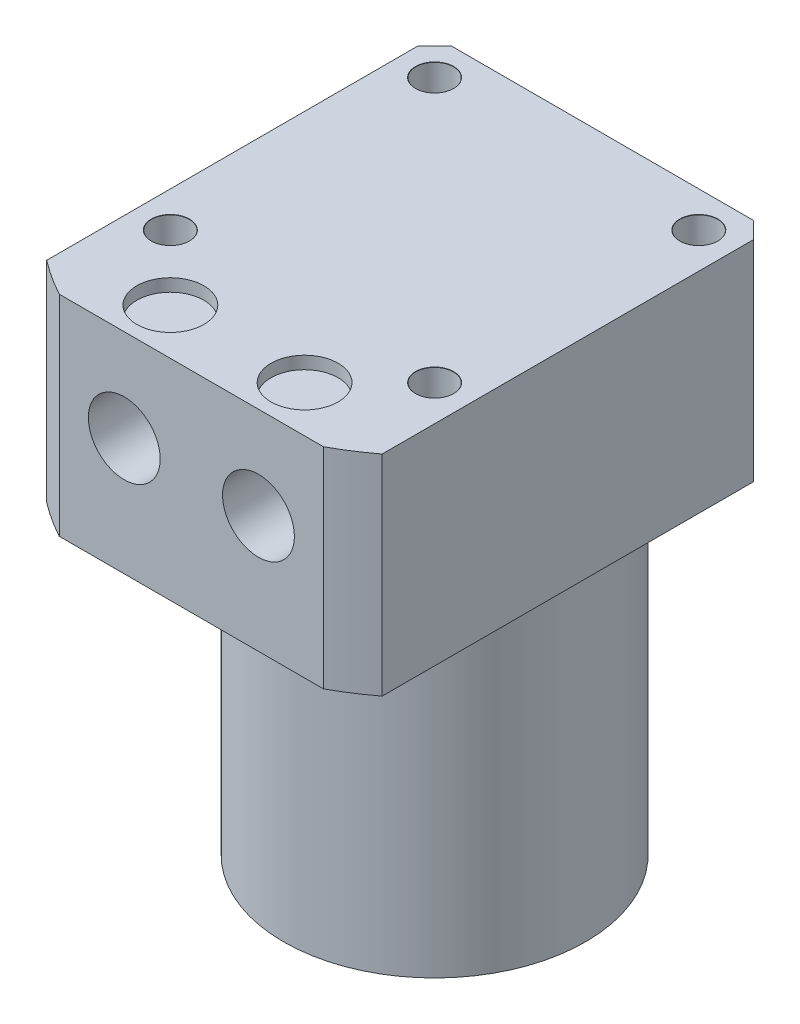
ISO-10303-21;
HEADER;
FILE_DESCRIPTION(('STEP AP214'),'2;1');
FILE_NAME('part.step','',(''),(''),'','','');
FILE_SCHEMA(('AUTOMOTIVE_DESIGN { 1 0 10303 214 1 1 1 1 }'));
ENDSEC;
DATA;
#1=APPLICATION_CONTEXT('core data for automotive mechanical design processes');
#2=APPLICATION_PROTOCOL_DEFINITION('international standard','automotive_design',2000,#1);
#3=PRODUCT_CONTEXT('',#1,'mechanical');
#4=PRODUCT('Part','Part','',(#3));
#5=PRODUCT_RELATED_PRODUCT_CATEGORY('part','',(#4));
#6=PRODUCT_DEFINITION_FORMATION('','',#4);
#7=PRODUCT_DEFINITION_CONTEXT('part definition',#1,'design');
#8=PRODUCT_DEFINITION('design','',#6,#7);
#9=PRODUCT_DEFINITION_SHAPE('','',#8);
#10=(LENGTH_UNIT() NAMED_UNIT(*) SI_UNIT(.MILLI.,.METRE.));
#11=(NAMED_UNIT(*) PLANE_ANGLE_UNIT() SI_UNIT($,.RADIAN.));
#12=(NAMED_UNIT(*) SI_UNIT($,.STERADIAN.) SOLID_ANGLE_UNIT());
#13=UNCERTAINTY_MEASURE_WITH_UNIT(LENGTH_MEASURE(1.E-05),#10,'distance_accuracy_value','');
#14=(GEOMETRIC_REPRESENTATION_CONTEXT(3) GLOBAL_UNCERTAINTY_ASSIGNED_CONTEXT((#13)) GLOBAL_UNIT_ASSIGNED_CONTEXT((#10,
#11,#12)) REPRESENTATION_CONTEXT('',''));
#15=CARTESIAN_POINT('',(0.,0.,0.));
#16=DIRECTION('',(0.,0.,1.));
#17=DIRECTION('',(1.,0.,0.));
#18=AXIS2_PLACEMENT_3D('',#15,#16,#17);
#19=CARTESIAN_POINT('',(-18.,39.5,0.));
#20=DIRECTION('',(0.,-1.,0.));
#21=DIRECTION('',(0.,0.,-1.));
#22=AXIS2_PLACEMENT_3D('',#19,#20,#21);
#23=PLANE('',#22);
#24=CARTESIAN_POINT('',(-15.75,39.5,-15.75));
#25=DIRECTION('',(0.,-1.,0.));
#26=DIRECTION('',(0.,0.,-1.));
#27=AXIS2_PLACEMENT_3D('',#24,#25,#26);
#28=CIRCLE('',#27,4.);
#29=CARTESIAN_POINT('',(-15.75,39.5,-19.75));
#30=VERTEX_POINT('',#29);
#31=EDGE_CURVE('E337',#30,#30,#28,.T.);
#32=ORIENTED_EDGE('',*,*,#31,.F.);
#33=EDGE_LOOP('',(#32));
#34=FACE_BOUND('',#33,.T.);
#35=CARTESIAN_POINT('',(15.75,39.5,-15.75));
#36=DIRECTION('',(0.,-1.,0.));
#37=DIRECTION('',(0.,0.,-1.));
#38=AXIS2_PLACEMENT_3D('',#35,#36,#37);
#39=CIRCLE('',#38,4.);
#40=CARTESIAN_POINT('',(15.75,39.5,-19.75));
#41=VERTEX_POINT('',#40);
#42=EDGE_CURVE('E352',#41,#41,#39,.T.);
#43=ORIENTED_EDGE('',*,*,#42,.F.);
#44=EDGE_LOOP('',(#43));
#45=FACE_BOUND('',#44,.T.);
#46=CARTESIAN_POINT('',(15.75,39.5,15.75));
#47=DIRECTION('',(0.,-1.,0.));
#48=DIRECTION('',(0.,0.,-1.));
#49=AXIS2_PLACEMENT_3D('',#46,#47,#48);
#50=CIRCLE('',#49,4.);
#51=CARTESIAN_POINT('',(15.75,39.5,11.75));
#52=VERTEX_POINT('',#51);
#53=EDGE_CURVE('E367',#52,#52,#50,.T.);
#54=ORIENTED_EDGE('',*,*,#53,.F.);
#55=EDGE_LOOP('',(#54));
#56=FACE_BOUND('',#55,.T.);
#57=CARTESIAN_POINT('',(-15.75,39.5,15.75));
#58=DIRECTION('',(0.,-1.,0.));
#59=DIRECTION('',(0.,0.,-1.));
#60=AXIS2_PLACEMENT_3D('',#57,#58,#59);
#61=CIRCLE('',#60,4.);
#62=CARTESIAN_POINT('',(-15.75,39.5,11.75));
#63=VERTEX_POINT('',#62);
#64=EDGE_CURVE('E382',#63,#63,#61,.T.);
#65=ORIENTED_EDGE('',*,*,#64,.F.);
#66=EDGE_LOOP('',(#65));
#67=FACE_BOUND('',#66,.T.);
#68=CARTESIAN_POINT('',(0.,39.5,0.));
#69=DIRECTION('',(0.,1.,0.));
#70=DIRECTION('',(0.,0.,1.));
#71=AXIS2_PLACEMENT_3D('',#68,#69,#70);
#72=CIRCLE('',#71,18.);
#73=CARTESIAN_POINT('',(0.,39.5,18.));
#74=VERTEX_POINT('',#73);
#75=EDGE_CURVE('E134',#74,#74,#72,.T.);
#76=ORIENTED_EDGE('',*,*,#75,.T.);
#77=EDGE_LOOP('',(#76));
#78=FACE_BOUND('',#77,.T.);
#79=DIRECTION('',(1.,0.,0.));
#80=VECTOR('',#79,1.);
#81=CARTESIAN_POINT('',(-18.,39.5,-20.));
#82=LINE('',#81,#80);
#83=CARTESIAN_POINT('',(-18.,39.5,-20.));
#84=VERTEX_POINT('',#83);
#85=CARTESIAN_POINT('',(18.,39.5,-20.));
#86=VERTEX_POINT('',#85);
#87=EDGE_CURVE('E108',#84,#86,#82,.T.);
#88=ORIENTED_EDGE('',*,*,#87,.T.);
#89=DIRECTION('',(-0.70710678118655,0.,-0.707106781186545));
#90=VECTOR('',#89,1.);
#91=CARTESIAN_POINT('',(9.99999999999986,39.5,-28.0000000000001));
#92=LINE('',#91,#90);
#93=CARTESIAN_POINT('',(20.,39.5,-18.));
#94=VERTEX_POINT('',#93);
#95=EDGE_CURVE('E42',#86,#94,#92,.F.);
#96=ORIENTED_EDGE('',*,*,#95,.T.);
#97=DIRECTION('',(0.,0.,1.));
#98=VECTOR('',#97,1.);
#99=CARTESIAN_POINT('',(20.,39.5,0.));
#100=LINE('',#99,#98);
#101=CARTESIAN_POINT('',(20.,39.5,26.2488094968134));
#102=VERTEX_POINT('',#101);
#103=EDGE_CURVE('E123',#94,#102,#100,.T.);
#104=ORIENTED_EDGE('',*,*,#103,.T.);
#105=CARTESIAN_POINT('',(0.,39.5,0.));
#106=DIRECTION('',(0.,1.,0.));
#107=DIRECTION('',(0.,0.,1.));
#108=AXIS2_PLACEMENT_3D('',#105,#106,#107);
#109=CIRCLE('',#108,33.);
#110=CARTESIAN_POINT('',(15.7480157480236,39.5,29.));
#111=VERTEX_POINT('',#110);
#112=EDGE_CURVE('E131',#111,#102,#109,.T.);
#113=ORIENTED_EDGE('',*,*,#112,.F.);
#114=DIRECTION('',(-1.,0.,0.));
#115=VECTOR('',#114,1.);
#116=CARTESIAN_POINT('',(-18.,39.5,29.));
#117=LINE('',#116,#115);
#118=CARTESIAN_POINT('',(-15.7480157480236,39.5,29.));
#119=VERTEX_POINT('',#118);
#120=EDGE_CURVE('E178',#111,#119,#117,.T.);
#121=ORIENTED_EDGE('',*,*,#120,.T.);
#122=CARTESIAN_POINT('',(-20.,39.5,26.2488094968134));
#123=VERTEX_POINT('',#122);
#124=EDGE_CURVE('E126',#123,#119,#109,.T.);
#125=ORIENTED_EDGE('',*,*,#124,.F.);
#126=DIRECTION('',(0.,0.,-1.));
#127=VECTOR('',#126,1.);
#128=CARTESIAN_POINT('',(-20.,39.5,0.));
#129=LINE('',#128,#127);
#130=CARTESIAN_POINT('',(-20.,39.5,-18.));
#131=VERTEX_POINT('',#130);
#132=EDGE_CURVE('E114',#123,#131,#129,.T.);
#133=ORIENTED_EDGE('',*,*,#132,.T.);
#134=DIRECTION('',(-0.707106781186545,0.,0.70710678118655));
#135=VECTOR('',#134,1.);
#136=CARTESIAN_POINT('',(-28.,39.5,-9.99999999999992));
#137=LINE('',#136,#135);
#138=EDGE_CURVE('E154',#131,#84,#137,.F.);
#139=ORIENTED_EDGE('',*,*,#138,.T.);
#140=EDGE_LOOP('',(#88,#96,#104,#113,#121,#125,#133,#139));
#141=FACE_BOUND('',#140,.T.);
#142=ADVANCED_FACE('F34',(#34,#45,#56,#67,#78,#141),#23,.T.);
#143=CARTESIAN_POINT('',(0.,87.0508296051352,0.));
#144=DIRECTION('',(0.,1.,0.));
#145=DIRECTION('',(0.,0.,1.));
#146=AXIS2_PLACEMENT_3D('',#143,#144,#145);
#147=CYLINDRICAL_SURFACE('',#146,33.);
#148=ORIENTED_EDGE('',*,*,#112,.T.);
#149=DIRECTION('',(0.,1.,0.));
#150=VECTOR('',#149,1.);
#151=CARTESIAN_POINT('',(20.,87.0508296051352,26.2488094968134));
#152=LINE('',#151,#150);
#153=CARTESIAN_POINT('',(20.,64.5,26.2488094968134));
#154=VERTEX_POINT('',#153);
#155=EDGE_CURVE('E127',#102,#154,#152,.T.);
#156=ORIENTED_EDGE('',*,*,#155,.T.);
#157=CARTESIAN_POINT('',(0.,64.5,0.));
#158=DIRECTION('',(0.,1.,0.));
#159=DIRECTION('',(0.,0.,1.));
#160=AXIS2_PLACEMENT_3D('',#157,#158,#159);
#161=CIRCLE('',#160,33.);
#162=CARTESIAN_POINT('',(15.7480157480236,64.5,29.));
#163=VERTEX_POINT('',#162);
#164=EDGE_CURVE('E122',#163,#154,#161,.T.);
#165=ORIENTED_EDGE('',*,*,#164,.F.);
#166=DIRECTION('',(0.,1.,0.));
#167=VECTOR('',#166,1.);
#168=CARTESIAN_POINT('',(15.7480157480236,87.0508296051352,29.));
#169=LINE('',#168,#167);
#170=EDGE_CURVE('E181',#163,#111,#169,.F.);
#171=ORIENTED_EDGE('',*,*,#170,.T.);
#172=EDGE_LOOP('',(#148,#156,#165,#171));
#173=FACE_BOUND('',#172,.T.);
#174=ADVANCED_FACE('F185',(#173),#147,.T.);
#175=ORIENTED_EDGE('',*,*,#124,.T.);
#176=DIRECTION('',(0.,1.,0.));
#177=VECTOR('',#176,1.);
#178=CARTESIAN_POINT('',(-15.7480157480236,87.0508296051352,29.));
#179=LINE('',#178,#177);
#180=CARTESIAN_POINT('',(-15.7480157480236,64.5,29.));
#181=VERTEX_POINT('',#180);
#182=EDGE_CURVE('E121',#119,#181,#179,.T.);
#183=ORIENTED_EDGE('',*,*,#182,.T.);
#184=CARTESIAN_POINT('',(-20.,64.5,26.2488094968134));
#185=VERTEX_POINT('',#184);
#186=EDGE_CURVE('E105',#185,#181,#161,.T.);
#187=ORIENTED_EDGE('',*,*,#186,.F.);
#188=DIRECTION('',(0.,1.,0.));
#189=VECTOR('',#188,1.);
#190=CARTESIAN_POINT('',(-20.,87.0508296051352,26.2488094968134));
#191=LINE('',#190,#189);
#192=EDGE_CURVE('E112',#185,#123,#191,.F.);
#193=ORIENTED_EDGE('',*,*,#192,.T.);
#194=EDGE_LOOP('',(#175,#183,#187,#193));
#195=FACE_BOUND('',#194,.T.);
#196=ADVANCED_FACE('F120',(#195),#147,.T.);
#197=CARTESIAN_POINT('',(-33.,64.5,0.));
#198=DIRECTION('',(0.,1.,0.));
#199=DIRECTION('',(0.,0.,1.));
#200=AXIS2_PLACEMENT_3D('',#197,#198,#199);
#201=PLANE('',#200);
#202=CARTESIAN_POINT('',(-15.75,64.5,-15.75));
#203=DIRECTION('',(0.,-1.,0.));
#204=DIRECTION('',(0.,0.,-1.));
#205=AXIS2_PLACEMENT_3D('',#202,#203,#204);
#206=CIRCLE('',#205,2.27499999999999);
#207=CARTESIAN_POINT('',(-15.75,64.5,-18.025));
#208=VERTEX_POINT('',#207);
#209=EDGE_CURVE('E338',#208,#208,#206,.T.);
#210=ORIENTED_EDGE('',*,*,#209,.T.);
#211=EDGE_LOOP('',(#210));
#212=FACE_BOUND('',#211,.T.);
#213=CARTESIAN_POINT('',(15.75,64.5,-15.75));
#214=DIRECTION('',(0.,-1.,0.));
#215=DIRECTION('',(0.,0.,-1.));
#216=AXIS2_PLACEMENT_3D('',#213,#214,#215);
#217=CIRCLE('',#216,2.27499999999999);
#218=CARTESIAN_POINT('',(15.75,64.5,-18.025));
#219=VERTEX_POINT('',#218);
#220=EDGE_CURVE('E349',#219,#219,#217,.T.);
#221=ORIENTED_EDGE('',*,*,#220,.T.);
#222=EDGE_LOOP('',(#221));
#223=FACE_BOUND('',#222,.T.);
#224=CARTESIAN_POINT('',(15.75,64.5,15.75));
#225=DIRECTION('',(0.,-1.,0.));
#226=DIRECTION('',(0.,0.,-1.));
#227=AXIS2_PLACEMENT_3D('',#224,#225,#226);
#228=CIRCLE('',#227,2.27499999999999);
#229=CARTESIAN_POINT('',(15.75,64.5,13.475));
#230=VERTEX_POINT('',#229);
#231=EDGE_CURVE('E364',#230,#230,#228,.T.);
#232=ORIENTED_EDGE('',*,*,#231,.T.);
#233=EDGE_LOOP('',(#232));
#234=FACE_BOUND('',#233,.T.);
#235=CARTESIAN_POINT('',(-15.75,64.5,15.75));
#236=DIRECTION('',(0.,-1.,0.));
#237=DIRECTION('',(0.,0.,-1.));
#238=AXIS2_PLACEMENT_3D('',#235,#236,#237);
#239=CIRCLE('',#238,2.27499999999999);
#240=CARTESIAN_POINT('',(-15.75,64.5,13.475));
#241=VERTEX_POINT('',#240);
#242=EDGE_CURVE('E379',#241,#241,#239,.T.);
#243=ORIENTED_EDGE('',*,*,#242,.T.);
#244=EDGE_LOOP('',(#243));
#245=FACE_BOUND('',#244,.T.);
#246=CARTESIAN_POINT('',(-8.,64.5,23.5));
#247=DIRECTION('',(0.,1.,0.));
#248=DIRECTION('',(0.,0.,1.));
#249=AXIS2_PLACEMENT_3D('',#246,#247,#248);
#250=CIRCLE('',#249,4.);
#251=CARTESIAN_POINT('',(-8.,64.5,27.5));
#252=VERTEX_POINT('',#251);
#253=EDGE_CURVE('E406',#252,#252,#250,.T.);
#254=ORIENTED_EDGE('',*,*,#253,.F.);
#255=EDGE_LOOP('',(#254));
#256=FACE_BOUND('',#255,.T.);
#257=CARTESIAN_POINT('',(8.,64.5,23.5));
#258=DIRECTION('',(0.,1.,0.));
#259=DIRECTION('',(0.,0.,1.));
#260=AXIS2_PLACEMENT_3D('',#257,#258,#259);
#261=CIRCLE('',#260,4.);
#262=CARTESIAN_POINT('',(8.,64.5,27.5));
#263=VERTEX_POINT('',#262);
#264=EDGE_CURVE('E171',#263,#263,#261,.T.);
#265=ORIENTED_EDGE('',*,*,#264,.F.);
#266=EDGE_LOOP('',(#265));
#267=FACE_BOUND('',#266,.T.);
#268=DIRECTION('',(0.,0.,-1.));
#269=VECTOR('',#268,1.);
#270=CARTESIAN_POINT('',(20.,64.5,0.));
#271=LINE('',#270,#269);
#272=CARTESIAN_POINT('',(20.,64.5,-18.));
#273=VERTEX_POINT('',#272);
#274=EDGE_CURVE('E140',#154,#273,#271,.T.);
#275=ORIENTED_EDGE('',*,*,#274,.T.);
#276=DIRECTION('',(0.70710678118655,0.,0.707106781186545));
#277=VECTOR('',#276,1.);
#278=CARTESIAN_POINT('',(2.49999999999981,64.5,-35.5));
#279=LINE('',#278,#277);
#280=CARTESIAN_POINT('',(18.,64.5,-20.));
#281=VERTEX_POINT('',#280);
#282=EDGE_CURVE('E148',#273,#281,#279,.F.);
#283=ORIENTED_EDGE('',*,*,#282,.T.);
#284=DIRECTION('',(-1.,0.,0.));
#285=VECTOR('',#284,1.);
#286=CARTESIAN_POINT('',(-20.,64.5,-20.));
#287=LINE('',#286,#285);
#288=CARTESIAN_POINT('',(-18.,64.5,-20.));
#289=VERTEX_POINT('',#288);
#290=EDGE_CURVE('E109',#281,#289,#287,.T.);
#291=ORIENTED_EDGE('',*,*,#290,.T.);
#292=DIRECTION('',(0.707106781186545,0.,-0.70710678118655));
#293=VECTOR('',#292,1.);
#294=CARTESIAN_POINT('',(-35.4999999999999,64.5,-2.49999999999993));
#295=LINE('',#294,#293);
#296=CARTESIAN_POINT('',(-20.,64.5,-18.));
#297=VERTEX_POINT('',#296);
#298=EDGE_CURVE('E107',#289,#297,#295,.F.);
#299=ORIENTED_EDGE('',*,*,#298,.T.);
#300=DIRECTION('',(0.,0.,1.));
#301=VECTOR('',#300,1.);
#302=CARTESIAN_POINT('',(-20.,64.5,-20.));
#303=LINE('',#302,#301);
#304=EDGE_CURVE('E99',#297,#185,#303,.T.);
#305=ORIENTED_EDGE('',*,*,#304,.T.);
#306=ORIENTED_EDGE('',*,*,#186,.T.);
#307=DIRECTION('',(1.,0.,0.));
#308=VECTOR('',#307,1.);
#309=CARTESIAN_POINT('',(-33.,64.5,29.));
#310=LINE('',#309,#308);
#311=EDGE_CURVE('E142',#181,#163,#310,.T.);
#312=ORIENTED_EDGE('',*,*,#311,.T.);
#313=ORIENTED_EDGE('',*,*,#164,.T.);
#314=EDGE_LOOP('',(#275,#283,#291,#299,#305,#306,#312,#313));
#315=FACE_BOUND('',#314,.T.);
#316=ADVANCED_FACE('F102',(#212,#223,#234,#245,#256,#267,#315),#201,.T.);
#317=CARTESIAN_POINT('',(0.,0.,0.));
#318=DIRECTION('',(0.,-1.,0.));
#319=DIRECTION('',(0.,0.,-1.));
#320=AXIS2_PLACEMENT_3D('',#317,#318,#319);
#321=PLANE('',#320);
#322=CARTESIAN_POINT('',(0.,0.,0.));
#323=DIRECTION('',(0.,1.,0.));
#324=DIRECTION('',(0.,0.,1.));
#325=AXIS2_PLACEMENT_3D('',#322,#323,#324);
#326=CIRCLE('',#325,18.);
#327=CARTESIAN_POINT('',(0.,0.,18.));
#328=VERTEX_POINT('',#327);
#329=EDGE_CURVE('E137',#328,#328,#326,.T.);
#330=ORIENTED_EDGE('',*,*,#329,.F.);
#331=EDGE_LOOP('',(#330));
#332=FACE_BOUND('',#331,.T.);
#333=ADVANCED_FACE('F213',(#332),#321,.T.);
#334=CARTESIAN_POINT('',(0.,87.0508296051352,0.));
#335=DIRECTION('',(0.,1.,0.));
#336=DIRECTION('',(0.,0.,1.));
#337=AXIS2_PLACEMENT_3D('',#334,#335,#336);
#338=CYLINDRICAL_SURFACE('',#337,18.);
#339=ORIENTED_EDGE('',*,*,#329,.T.);
#340=EDGE_LOOP('',(#339));
#341=FACE_BOUND('',#340,.T.);
#342=ORIENTED_EDGE('',*,*,#75,.F.);
#343=EDGE_LOOP('',(#342));
#344=FACE_BOUND('',#343,.T.);
#345=ADVANCED_FACE('F210',(#341,#344),#338,.T.);
#346=CARTESIAN_POINT('',(-20.,0.,-20.));
#347=DIRECTION('',(0.,0.,-1.));
#348=DIRECTION('',(-1.,0.,0.));
#349=AXIS2_PLACEMENT_3D('',#346,#347,#348);
#350=PLANE('',#349);
#351=ORIENTED_EDGE('',*,*,#290,.F.);
#352=DIRECTION('',(0.,-1.,0.));
#353=VECTOR('',#352,1.);
#354=CARTESIAN_POINT('',(18.,0.,-20.));
#355=LINE('',#354,#353);
#356=EDGE_CURVE('E55',#281,#86,#355,.T.);
#357=ORIENTED_EDGE('',*,*,#356,.T.);
#358=ORIENTED_EDGE('',*,*,#87,.F.);
#359=DIRECTION('',(0.,1.,0.));
#360=VECTOR('',#359,1.);
#361=CARTESIAN_POINT('',(-18.,0.,-20.));
#362=LINE('',#361,#360);
#363=EDGE_CURVE('E150',#84,#289,#362,.T.);
#364=ORIENTED_EDGE('',*,*,#363,.T.);
#365=EDGE_LOOP('',(#351,#357,#358,#364));
#366=FACE_BOUND('',#365,.T.);
#367=ADVANCED_FACE('F166',(#366),#350,.T.);
#368=CARTESIAN_POINT('',(-20.,0.,-20.));
#369=DIRECTION('',(-1.,0.,0.));
#370=DIRECTION('',(0.,0.,1.));
#371=AXIS2_PLACEMENT_3D('',#368,#369,#370);
#372=PLANE('',#371);
#373=ORIENTED_EDGE('',*,*,#304,.F.);
#374=DIRECTION('',(0.,-1.,0.));
#375=VECTOR('',#374,1.);
#376=CARTESIAN_POINT('',(-20.,0.,-18.));
#377=LINE('',#376,#375);
#378=EDGE_CURVE('E12',#297,#131,#377,.T.);
#379=ORIENTED_EDGE('',*,*,#378,.T.);
#380=ORIENTED_EDGE('',*,*,#132,.F.);
#381=ORIENTED_EDGE('',*,*,#192,.F.);
#382=EDGE_LOOP('',(#373,#379,#380,#381));
#383=FACE_BOUND('',#382,.T.);
#384=ADVANCED_FACE('F113',(#383),#372,.T.);
#385=CARTESIAN_POINT('',(20.,0.,-20.));
#386=DIRECTION('',(1.,0.,0.));
#387=DIRECTION('',(0.,0.,-1.));
#388=AXIS2_PLACEMENT_3D('',#385,#386,#387);
#389=PLANE('',#388);
#390=ORIENTED_EDGE('',*,*,#103,.F.);
#391=DIRECTION('',(0.,1.,0.));
#392=VECTOR('',#391,1.);
#393=CARTESIAN_POINT('',(20.,0.,-18.));
#394=LINE('',#393,#392);
#395=EDGE_CURVE('E144',#94,#273,#394,.T.);
#396=ORIENTED_EDGE('',*,*,#395,.T.);
#397=ORIENTED_EDGE('',*,*,#274,.F.);
#398=ORIENTED_EDGE('',*,*,#155,.F.);
#399=EDGE_LOOP('',(#390,#396,#397,#398));
#400=FACE_BOUND('',#399,.T.);
#401=ADVANCED_FACE('F163',(#400),#389,.T.);
#402=CARTESIAN_POINT('',(-20.,0.,29.));
#403=DIRECTION('',(0.,0.,1.));
#404=DIRECTION('',(1.,0.,0.));
#405=AXIS2_PLACEMENT_3D('',#402,#403,#404);
#406=PLANE('',#405);
#407=CARTESIAN_POINT('',(-8.,53.5,29.));
#408=DIRECTION('',(0.,0.,1.));
#409=DIRECTION('',(1.,0.,0.));
#410=AXIS2_PLACEMENT_3D('',#407,#408,#409);
#411=CIRCLE('',#410,4.283);
#412=CARTESIAN_POINT('',(-3.717,53.5,29.));
#413=VERTEX_POINT('',#412);
#414=EDGE_CURVE('E394',#413,#413,#411,.T.);
#415=ORIENTED_EDGE('',*,*,#414,.F.);
#416=EDGE_LOOP('',(#415));
#417=FACE_BOUND('',#416,.T.);
#418=CARTESIAN_POINT('',(8.,53.5,29.));
#419=DIRECTION('',(0.,0.,1.));
#420=DIRECTION('',(1.,0.,0.));
#421=AXIS2_PLACEMENT_3D('',#418,#419,#420);
#422=CIRCLE('',#421,4.283);
#423=CARTESIAN_POINT('',(12.283,53.5,29.));
#424=VERTEX_POINT('',#423);
#425=EDGE_CURVE('E400',#424,#424,#422,.T.);
#426=ORIENTED_EDGE('',*,*,#425,.F.);
#427=EDGE_LOOP('',(#426));
#428=FACE_BOUND('',#427,.T.);
#429=ORIENTED_EDGE('',*,*,#311,.F.);
#430=ORIENTED_EDGE('',*,*,#182,.F.);
#431=ORIENTED_EDGE('',*,*,#120,.F.);
#432=ORIENTED_EDGE('',*,*,#170,.F.);
#433=EDGE_LOOP('',(#429,#430,#431,#432));
#434=FACE_BOUND('',#433,.T.);
#435=ADVANCED_FACE('F187',(#417,#428,#434),#406,.T.);
#436=CARTESIAN_POINT('',(20.,0.,-18.));
#437=DIRECTION('',(-0.707106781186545,0.,0.70710678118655));
#438=DIRECTION('',(0.70710678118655,0.,0.707106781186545));
#439=AXIS2_PLACEMENT_3D('',#436,#437,#438);
#440=PLANE('',#439);
#441=ORIENTED_EDGE('',*,*,#95,.F.);
#442=ORIENTED_EDGE('',*,*,#356,.F.);
#443=ORIENTED_EDGE('',*,*,#282,.F.);
#444=ORIENTED_EDGE('',*,*,#395,.F.);
#445=EDGE_LOOP('',(#441,#442,#443,#444));
#446=FACE_BOUND('',#445,.T.);
#447=ADVANCED_FACE('F165',(#446),#440,.F.);
#448=CARTESIAN_POINT('',(-18.,0.,-20.));
#449=DIRECTION('',(0.70710678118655,0.,0.707106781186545));
#450=DIRECTION('',(0.707106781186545,0.,-0.70710678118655));
#451=AXIS2_PLACEMENT_3D('',#448,#449,#450);
#452=PLANE('',#451);
#453=ORIENTED_EDGE('',*,*,#138,.F.);
#454=ORIENTED_EDGE('',*,*,#378,.F.);
#455=ORIENTED_EDGE('',*,*,#298,.F.);
#456=ORIENTED_EDGE('',*,*,#363,.F.);
#457=EDGE_LOOP('',(#453,#454,#455,#456));
#458=FACE_BOUND('',#457,.T.);
#459=ADVANCED_FACE('F36',(#458),#452,.F.);
#460=CARTESIAN_POINT('',(8.,63.,23.5));
#461=DIRECTION('',(0.,-1.,0.));
#462=DIRECTION('',(0.,0.,-1.));
#463=AXIS2_PLACEMENT_3D('',#460,#461,#462);
#464=PLANE('',#463);
#465=CARTESIAN_POINT('',(8.,63.,23.5));
#466=DIRECTION('',(0.,1.,0.));
#467=DIRECTION('',(0.,0.,1.));
#468=AXIS2_PLACEMENT_3D('',#465,#466,#467);
#469=CIRCLE('',#468,4.);
#470=CARTESIAN_POINT('',(8.,63.,27.5));
#471=VERTEX_POINT('',#470);
#472=EDGE_CURVE('E168',#471,#471,#469,.T.);
#473=ORIENTED_EDGE('',*,*,#472,.T.);
#474=EDGE_LOOP('',(#473));
#475=FACE_BOUND('',#474,.T.);
#476=ADVANCED_FACE('F191',(#475),#464,.F.);
#477=CARTESIAN_POINT('',(8.,64.5,23.5));
#478=DIRECTION('',(0.,1.,0.));
#479=DIRECTION('',(0.,0.,1.));
#480=AXIS2_PLACEMENT_3D('',#477,#478,#479);
#481=CYLINDRICAL_SURFACE('',#480,4.);
#482=ORIENTED_EDGE('',*,*,#472,.F.);
#483=EDGE_LOOP('',(#482));
#484=FACE_BOUND('',#483,.T.);
#485=ORIENTED_EDGE('',*,*,#264,.T.);
#486=EDGE_LOOP('',(#485));
#487=FACE_BOUND('',#486,.T.);
#488=ADVANCED_FACE('F196',(#484,#487),#481,.F.);
#489=CARTESIAN_POINT('',(-8.,63.,23.5));
#490=DIRECTION('',(0.,-1.,0.));
#491=DIRECTION('',(0.,0.,-1.));
#492=AXIS2_PLACEMENT_3D('',#489,#490,#491);
#493=PLANE('',#492);
#494=CARTESIAN_POINT('',(-8.,63.,23.5));
#495=DIRECTION('',(0.,1.,0.));
#496=DIRECTION('',(0.,0.,1.));
#497=AXIS2_PLACEMENT_3D('',#494,#495,#496);
#498=CIRCLE('',#497,4.);
#499=CARTESIAN_POINT('',(-8.,63.,27.5));
#500=VERTEX_POINT('',#499);
#501=EDGE_CURVE('E409',#500,#500,#498,.T.);
#502=ORIENTED_EDGE('',*,*,#501,.T.);
#503=EDGE_LOOP('',(#502));
#504=FACE_BOUND('',#503,.T.);
#505=ADVANCED_FACE('F242',(#504),#493,.F.);
#506=CARTESIAN_POINT('',(-8.,64.5,23.5));
#507=DIRECTION('',(0.,1.,0.));
#508=DIRECTION('',(0.,0.,1.));
#509=AXIS2_PLACEMENT_3D('',#506,#507,#508);
#510=CYLINDRICAL_SURFACE('',#509,4.);
#511=ORIENTED_EDGE('',*,*,#501,.F.);
#512=EDGE_LOOP('',(#511));
#513=FACE_BOUND('',#512,.T.);
#514=ORIENTED_EDGE('',*,*,#253,.T.);
#515=EDGE_LOOP('',(#514));
#516=FACE_BOUND('',#515,.T.);
#517=ADVANCED_FACE('F246',(#513,#516),#510,.F.);
#518=CARTESIAN_POINT('',(7.99999999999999,53.5,6.82));
#519=DIRECTION('',(0.,0.,-1.));
#520=DIRECTION('',(-1.,0.,0.));
#521=AXIS2_PLACEMENT_3D('',#518,#519,#520);
#522=PLANE('',#521);
#523=CARTESIAN_POINT('',(8.,53.5,6.82));
#524=DIRECTION('',(0.,0.,1.));
#525=DIRECTION('',(1.,0.,0.));
#526=AXIS2_PLACEMENT_3D('',#523,#524,#525);
#527=CIRCLE('',#526,4.283);
#528=CARTESIAN_POINT('',(12.283,53.5,6.82));
#529=VERTEX_POINT('',#528);
#530=EDGE_CURVE('E403',#529,#529,#527,.T.);
#531=ORIENTED_EDGE('',*,*,#530,.T.);
#532=EDGE_LOOP('',(#531));
#533=FACE_BOUND('',#532,.T.);
#534=ADVANCED_FACE('F250',(#533),#522,.F.);
#535=CARTESIAN_POINT('',(8.,53.5,29.));
#536=DIRECTION('',(0.,0.,1.));
#537=DIRECTION('',(1.,0.,0.));
#538=AXIS2_PLACEMENT_3D('',#535,#536,#537);
#539=CYLINDRICAL_SURFACE('',#538,4.283);
#540=ORIENTED_EDGE('',*,*,#530,.F.);
#541=EDGE_LOOP('',(#540));
#542=FACE_BOUND('',#541,.T.);
#543=ORIENTED_EDGE('',*,*,#425,.T.);
#544=EDGE_LOOP('',(#543));
#545=FACE_BOUND('',#544,.T.);
#546=ADVANCED_FACE('F254',(#542,#545),#539,.F.);
#547=CARTESIAN_POINT('',(-8.00000000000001,53.5,6.82));
#548=DIRECTION('',(0.,0.,-1.));
#549=DIRECTION('',(-1.,0.,0.));
#550=AXIS2_PLACEMENT_3D('',#547,#548,#549);
#551=PLANE('',#550);
#552=CARTESIAN_POINT('',(-8.,53.5,6.82));
#553=DIRECTION('',(0.,0.,1.));
#554=DIRECTION('',(1.,0.,0.));
#555=AXIS2_PLACEMENT_3D('',#552,#553,#554);
#556=CIRCLE('',#555,4.283);
#557=CARTESIAN_POINT('',(-3.717,53.5,6.82));
#558=VERTEX_POINT('',#557);
#559=EDGE_CURVE('E397',#558,#558,#556,.T.);
#560=ORIENTED_EDGE('',*,*,#559,.T.);
#561=EDGE_LOOP('',(#560));
#562=FACE_BOUND('',#561,.T.);
#563=ADVANCED_FACE('F258',(#562),#551,.F.);
#564=CARTESIAN_POINT('',(-8.,53.5,29.));
#565=DIRECTION('',(0.,0.,1.));
#566=DIRECTION('',(1.,0.,0.));
#567=AXIS2_PLACEMENT_3D('',#564,#565,#566);
#568=CYLINDRICAL_SURFACE('',#567,4.283);
#569=ORIENTED_EDGE('',*,*,#559,.F.);
#570=EDGE_LOOP('',(#569));
#571=FACE_BOUND('',#570,.T.);
#572=ORIENTED_EDGE('',*,*,#414,.T.);
#573=EDGE_LOOP('',(#572));
#574=FACE_BOUND('',#573,.T.);
#575=ADVANCED_FACE('F262',(#571,#574),#568,.F.);
#576=CARTESIAN_POINT('',(-15.75,64.475,15.75));
#577=DIRECTION('',(0.,1.,0.));
#578=DIRECTION('',(0.,0.,1.));
#579=AXIS2_PLACEMENT_3D('',#576,#577,#578);
#580=CONICAL_SURFACE('',#579,2.25,0.785398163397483);
#581=ORIENTED_EDGE('',*,*,#242,.F.);
#582=EDGE_LOOP('',(#581));
#583=FACE_BOUND('',#582,.T.);
#584=CARTESIAN_POINT('',(-15.75,64.475,15.75));
#585=DIRECTION('',(0.,-1.,0.));
#586=DIRECTION('',(0.,0.,-1.));
#587=AXIS2_PLACEMENT_3D('',#584,#585,#586);
#588=CIRCLE('',#587,2.25);
#589=CARTESIAN_POINT('',(-15.75,64.475,13.5));
#590=VERTEX_POINT('',#589);
#591=EDGE_CURVE('E391',#590,#590,#588,.T.);
#592=ORIENTED_EDGE('',*,*,#591,.T.);
#593=EDGE_LOOP('',(#592));
#594=FACE_BOUND('',#593,.T.);
#595=ADVANCED_FACE('F266',(#583,#594),#580,.F.);
#596=CARTESIAN_POINT('',(-15.75,39.5,15.75));
#597=DIRECTION('',(0.,-1.,0.));
#598=DIRECTION('',(0.,0.,-1.));
#599=AXIS2_PLACEMENT_3D('',#596,#597,#598);
#600=CYLINDRICAL_SURFACE('',#599,2.25);
#601=ORIENTED_EDGE('',*,*,#591,.F.);
#602=EDGE_LOOP('',(#601));
#603=FACE_BOUND('',#602,.T.);
#604=CARTESIAN_POINT('',(-15.75,43.5,15.75));
#605=DIRECTION('',(0.,-1.,0.));
#606=DIRECTION('',(0.,0.,-1.));
#607=AXIS2_PLACEMENT_3D('',#604,#605,#606);
#608=CIRCLE('',#607,2.25);
#609=CARTESIAN_POINT('',(-15.75,43.5,13.5));
#610=VERTEX_POINT('',#609);
#611=EDGE_CURVE('E388',#610,#610,#608,.T.);
#612=ORIENTED_EDGE('',*,*,#611,.T.);
#613=EDGE_LOOP('',(#612));
#614=FACE_BOUND('',#613,.T.);
#615=ADVANCED_FACE('F270',(#603,#614),#600,.F.);
#616=CARTESIAN_POINT('',(-13.5,43.5,15.75));
#617=DIRECTION('',(0.,1.,0.));
#618=DIRECTION('',(0.,0.,1.));
#619=AXIS2_PLACEMENT_3D('',#616,#617,#618);
#620=PLANE('',#619);
#621=ORIENTED_EDGE('',*,*,#611,.F.);
#622=EDGE_LOOP('',(#621));
#623=FACE_BOUND('',#622,.T.);
#624=CARTESIAN_POINT('',(-15.75,43.5,15.75));
#625=DIRECTION('',(0.,-1.,0.));
#626=DIRECTION('',(0.,0.,-1.));
#627=AXIS2_PLACEMENT_3D('',#624,#625,#626);
#628=CIRCLE('',#627,4.);
#629=CARTESIAN_POINT('',(-15.75,43.5,11.75));
#630=VERTEX_POINT('',#629);
#631=EDGE_CURVE('E385',#630,#630,#628,.T.);
#632=ORIENTED_EDGE('',*,*,#631,.T.);
#633=EDGE_LOOP('',(#632));
#634=FACE_BOUND('',#633,.T.);
#635=ADVANCED_FACE('F274',(#623,#634),#620,.F.);
#636=CARTESIAN_POINT('',(-15.75,39.5,15.75));
#637=DIRECTION('',(0.,-1.,0.));
#638=DIRECTION('',(0.,0.,-1.));
#639=AXIS2_PLACEMENT_3D('',#636,#637,#638);
#640=CYLINDRICAL_SURFACE('',#639,4.);
#641=ORIENTED_EDGE('',*,*,#631,.F.);
#642=EDGE_LOOP('',(#641));
#643=FACE_BOUND('',#642,.T.);
#644=ORIENTED_EDGE('',*,*,#64,.T.);
#645=EDGE_LOOP('',(#644));
#646=FACE_BOUND('',#645,.T.);
#647=ADVANCED_FACE('F278',(#643,#646),#640,.F.);
#648=CARTESIAN_POINT('',(15.75,64.475,15.75));
#649=DIRECTION('',(0.,1.,0.));
#650=DIRECTION('',(0.,0.,1.));
#651=AXIS2_PLACEMENT_3D('',#648,#649,#650);
#652=CONICAL_SURFACE('',#651,2.25,0.785398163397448);
#653=ORIENTED_EDGE('',*,*,#231,.F.);
#654=EDGE_LOOP('',(#653));
#655=FACE_BOUND('',#654,.T.);
#656=CARTESIAN_POINT('',(15.75,64.475,15.75));
#657=DIRECTION('',(0.,-1.,0.));
#658=DIRECTION('',(0.,0.,-1.));
#659=AXIS2_PLACEMENT_3D('',#656,#657,#658);
#660=CIRCLE('',#659,2.25);
#661=CARTESIAN_POINT('',(15.75,64.475,13.5));
#662=VERTEX_POINT('',#661);
#663=EDGE_CURVE('E376',#662,#662,#660,.T.);
#664=ORIENTED_EDGE('',*,*,#663,.T.);
#665=EDGE_LOOP('',(#664));
#666=FACE_BOUND('',#665,.T.);
#667=ADVANCED_FACE('F282',(#655,#666),#652,.F.);
#668=CARTESIAN_POINT('',(15.75,39.5,15.75));
#669=DIRECTION('',(0.,-1.,0.));
#670=DIRECTION('',(0.,0.,-1.));
#671=AXIS2_PLACEMENT_3D('',#668,#669,#670);
#672=CYLINDRICAL_SURFACE('',#671,2.25);
#673=ORIENTED_EDGE('',*,*,#663,.F.);
#674=EDGE_LOOP('',(#673));
#675=FACE_BOUND('',#674,.T.);
#676=CARTESIAN_POINT('',(15.75,43.5,15.75));
#677=DIRECTION('',(0.,-1.,0.));
#678=DIRECTION('',(0.,0.,-1.));
#679=AXIS2_PLACEMENT_3D('',#676,#677,#678);
#680=CIRCLE('',#679,2.25);
#681=CARTESIAN_POINT('',(15.75,43.5,13.5));
#682=VERTEX_POINT('',#681);
#683=EDGE_CURVE('E373',#682,#682,#680,.T.);
#684=ORIENTED_EDGE('',*,*,#683,.T.);
#685=EDGE_LOOP('',(#684));
#686=FACE_BOUND('',#685,.T.);
#687=ADVANCED_FACE('F286',(#675,#686),#672,.F.);
#688=CARTESIAN_POINT('',(18.,43.5,15.75));
#689=DIRECTION('',(0.,1.,0.));
#690=DIRECTION('',(0.,0.,1.));
#691=AXIS2_PLACEMENT_3D('',#688,#689,#690);
#692=PLANE('',#691);
#693=ORIENTED_EDGE('',*,*,#683,.F.);
#694=EDGE_LOOP('',(#693));
#695=FACE_BOUND('',#694,.T.);
#696=CARTESIAN_POINT('',(15.75,43.5,15.75));
#697=DIRECTION('',(0.,-1.,0.));
#698=DIRECTION('',(0.,0.,-1.));
#699=AXIS2_PLACEMENT_3D('',#696,#697,#698);
#700=CIRCLE('',#699,4.);
#701=CARTESIAN_POINT('',(15.75,43.5,11.75));
#702=VERTEX_POINT('',#701);
#703=EDGE_CURVE('E370',#702,#702,#700,.T.);
#704=ORIENTED_EDGE('',*,*,#703,.T.);
#705=EDGE_LOOP('',(#704));
#706=FACE_BOUND('',#705,.T.);
#707=ADVANCED_FACE('F290',(#695,#706),#692,.F.);
#708=CARTESIAN_POINT('',(15.75,39.5,15.75));
#709=DIRECTION('',(0.,-1.,0.));
#710=DIRECTION('',(0.,0.,-1.));
#711=AXIS2_PLACEMENT_3D('',#708,#709,#710);
#712=CYLINDRICAL_SURFACE('',#711,4.);
#713=ORIENTED_EDGE('',*,*,#703,.F.);
#714=EDGE_LOOP('',(#713));
#715=FACE_BOUND('',#714,.T.);
#716=ORIENTED_EDGE('',*,*,#53,.T.);
#717=EDGE_LOOP('',(#716));
#718=FACE_BOUND('',#717,.T.);
#719=ADVANCED_FACE('F294',(#715,#718),#712,.F.);
#720=CARTESIAN_POINT('',(15.75,64.475,-15.75));
#721=DIRECTION('',(0.,1.,0.));
#722=DIRECTION('',(0.,0.,1.));
#723=AXIS2_PLACEMENT_3D('',#720,#721,#722);
#724=CONICAL_SURFACE('',#723,2.25,0.785398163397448);
#725=ORIENTED_EDGE('',*,*,#220,.F.);
#726=EDGE_LOOP('',(#725));
#727=FACE_BOUND('',#726,.T.);
#728=CARTESIAN_POINT('',(15.75,64.475,-15.75));
#729=DIRECTION('',(0.,-1.,0.));
#730=DIRECTION('',(0.,0.,-1.));
#731=AXIS2_PLACEMENT_3D('',#728,#729,#730);
#732=CIRCLE('',#731,2.25);
#733=CARTESIAN_POINT('',(15.75,64.475,-18.));
#734=VERTEX_POINT('',#733);
#735=EDGE_CURVE('E361',#734,#734,#732,.T.);
#736=ORIENTED_EDGE('',*,*,#735,.T.);
#737=EDGE_LOOP('',(#736));
#738=FACE_BOUND('',#737,.T.);
#739=ADVANCED_FACE('F298',(#727,#738),#724,.F.);
#740=CARTESIAN_POINT('',(15.75,39.5,-15.75));
#741=DIRECTION('',(0.,-1.,0.));
#742=DIRECTION('',(0.,0.,-1.));
#743=AXIS2_PLACEMENT_3D('',#740,#741,#742);
#744=CYLINDRICAL_SURFACE('',#743,2.25);
#745=ORIENTED_EDGE('',*,*,#735,.F.);
#746=EDGE_LOOP('',(#745));
#747=FACE_BOUND('',#746,.T.);
#748=CARTESIAN_POINT('',(15.75,43.5,-15.75));
#749=DIRECTION('',(0.,-1.,0.));
#750=DIRECTION('',(0.,0.,-1.));
#751=AXIS2_PLACEMENT_3D('',#748,#749,#750);
#752=CIRCLE('',#751,2.25);
#753=CARTESIAN_POINT('',(15.75,43.5,-18.));
#754=VERTEX_POINT('',#753);
#755=EDGE_CURVE('E358',#754,#754,#752,.T.);
#756=ORIENTED_EDGE('',*,*,#755,.T.);
#757=EDGE_LOOP('',(#756));
#758=FACE_BOUND('',#757,.T.);
#759=ADVANCED_FACE('F302',(#747,#758),#744,.F.);
#760=CARTESIAN_POINT('',(18.,43.5,-15.75));
#761=DIRECTION('',(0.,1.,0.));
#762=DIRECTION('',(0.,0.,1.));
#763=AXIS2_PLACEMENT_3D('',#760,#761,#762);
#764=PLANE('',#763);
#765=ORIENTED_EDGE('',*,*,#755,.F.);
#766=EDGE_LOOP('',(#765));
#767=FACE_BOUND('',#766,.T.);
#768=CARTESIAN_POINT('',(15.75,43.5,-15.75));
#769=DIRECTION('',(0.,-1.,0.));
#770=DIRECTION('',(0.,0.,-1.));
#771=AXIS2_PLACEMENT_3D('',#768,#769,#770);
#772=CIRCLE('',#771,4.);
#773=CARTESIAN_POINT('',(15.75,43.5,-19.75));
#774=VERTEX_POINT('',#773);
#775=EDGE_CURVE('E355',#774,#774,#772,.T.);
#776=ORIENTED_EDGE('',*,*,#775,.T.);
#777=EDGE_LOOP('',(#776));
#778=FACE_BOUND('',#777,.T.);
#779=ADVANCED_FACE('F306',(#767,#778),#764,.F.);
#780=CARTESIAN_POINT('',(15.75,39.5,-15.75));
#781=DIRECTION('',(0.,-1.,0.));
#782=DIRECTION('',(0.,0.,-1.));
#783=AXIS2_PLACEMENT_3D('',#780,#781,#782);
#784=CYLINDRICAL_SURFACE('',#783,4.);
#785=ORIENTED_EDGE('',*,*,#775,.F.);
#786=EDGE_LOOP('',(#785));
#787=FACE_BOUND('',#786,.T.);
#788=ORIENTED_EDGE('',*,*,#42,.T.);
#789=EDGE_LOOP('',(#788));
#790=FACE_BOUND('',#789,.T.);
#791=ADVANCED_FACE('F310',(#787,#790),#784,.F.);
#792=CARTESIAN_POINT('',(-15.75,64.475,-15.75));
#793=DIRECTION('',(0.,1.,0.));
#794=DIRECTION('',(0.,0.,1.));
#795=AXIS2_PLACEMENT_3D('',#792,#793,#794);
#796=CONICAL_SURFACE('',#795,2.25,0.785398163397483);
#797=ORIENTED_EDGE('',*,*,#209,.F.);
#798=EDGE_LOOP('',(#797));
#799=FACE_BOUND('',#798,.T.);
#800=CARTESIAN_POINT('',(-15.75,64.475,-15.75));
#801=DIRECTION('',(0.,-1.,0.));
#802=DIRECTION('',(0.,0.,-1.));
#803=AXIS2_PLACEMENT_3D('',#800,#801,#802);
#804=CIRCLE('',#803,2.25);
#805=CARTESIAN_POINT('',(-15.75,64.475,-18.));
#806=VERTEX_POINT('',#805);
#807=EDGE_CURVE('E346',#806,#806,#804,.T.);
#808=ORIENTED_EDGE('',*,*,#807,.T.);
#809=EDGE_LOOP('',(#808));
#810=FACE_BOUND('',#809,.T.);
#811=ADVANCED_FACE('F314',(#799,#810),#796,.F.);
#812=CARTESIAN_POINT('',(-15.75,39.5,-15.75));
#813=DIRECTION('',(0.,-1.,0.));
#814=DIRECTION('',(0.,0.,-1.));
#815=AXIS2_PLACEMENT_3D('',#812,#813,#814);
#816=CYLINDRICAL_SURFACE('',#815,2.25);
#817=ORIENTED_EDGE('',*,*,#807,.F.);
#818=EDGE_LOOP('',(#817));
#819=FACE_BOUND('',#818,.T.);
#820=CARTESIAN_POINT('',(-15.75,43.5,-15.75));
#821=DIRECTION('',(0.,-1.,0.));
#822=DIRECTION('',(0.,0.,-1.));
#823=AXIS2_PLACEMENT_3D('',#820,#821,#822);
#824=CIRCLE('',#823,2.25);
#825=CARTESIAN_POINT('',(-15.75,43.5,-18.));
#826=VERTEX_POINT('',#825);
#827=EDGE_CURVE('E340',#826,#826,#824,.T.);
#828=ORIENTED_EDGE('',*,*,#827,.T.);
#829=EDGE_LOOP('',(#828));
#830=FACE_BOUND('',#829,.T.);
#831=ADVANCED_FACE('F318',(#819,#830),#816,.F.);
#832=CARTESIAN_POINT('',(-13.5,43.5,-15.75));
#833=DIRECTION('',(0.,1.,0.));
#834=DIRECTION('',(0.,0.,1.));
#835=AXIS2_PLACEMENT_3D('',#832,#833,#834);
#836=PLANE('',#835);
#837=ORIENTED_EDGE('',*,*,#827,.F.);
#838=EDGE_LOOP('',(#837));
#839=FACE_BOUND('',#838,.T.);
#840=CARTESIAN_POINT('',(-15.75,43.5,-15.75));
#841=DIRECTION('',(0.,-1.,0.));
#842=DIRECTION('',(0.,0.,-1.));
#843=AXIS2_PLACEMENT_3D('',#840,#841,#842);
#844=CIRCLE('',#843,4.);
#845=CARTESIAN_POINT('',(-15.75,43.5,-19.75));
#846=VERTEX_POINT('',#845);
#847=EDGE_CURVE('E335',#846,#846,#844,.T.);
#848=ORIENTED_EDGE('',*,*,#847,.T.);
#849=EDGE_LOOP('',(#848));
#850=FACE_BOUND('',#849,.T.);
#851=ADVANCED_FACE('F322',(#839,#850),#836,.F.);
#852=CARTESIAN_POINT('',(-15.75,39.5,-15.75));
#853=DIRECTION('',(0.,-1.,0.));
#854=DIRECTION('',(0.,0.,-1.));
#855=AXIS2_PLACEMENT_3D('',#852,#853,#854);
#856=CYLINDRICAL_SURFACE('',#855,4.);
#857=ORIENTED_EDGE('',*,*,#847,.F.);
#858=EDGE_LOOP('',(#857));
#859=FACE_BOUND('',#858,.T.);
#860=ORIENTED_EDGE('',*,*,#31,.T.);
#861=EDGE_LOOP('',(#860));
#862=FACE_BOUND('',#861,.T.);
#863=ADVANCED_FACE('F326',(#859,#862),#856,.F.);
#864=CLOSED_SHELL('',(#142,#174,#196,#316,#333,#345,#367,#384,#401,#435,#447,#459,#476,#488,
#505,#517,#534,#546,#563,#575,#595,#615,#635,#647,#667,#687,#707,#719,#739,#759,#779,#791,#811,
#831,#851,#863));
#865=MANIFOLD_SOLID_BREP('B2',#864);
#866=ADVANCED_BREP_SHAPE_REPRESENTATION('',(#18,#865),#14);
#867=SHAPE_DEFINITION_REPRESENTATION(#9,#866);
ENDSEC;
END-ISO-10303-21;
